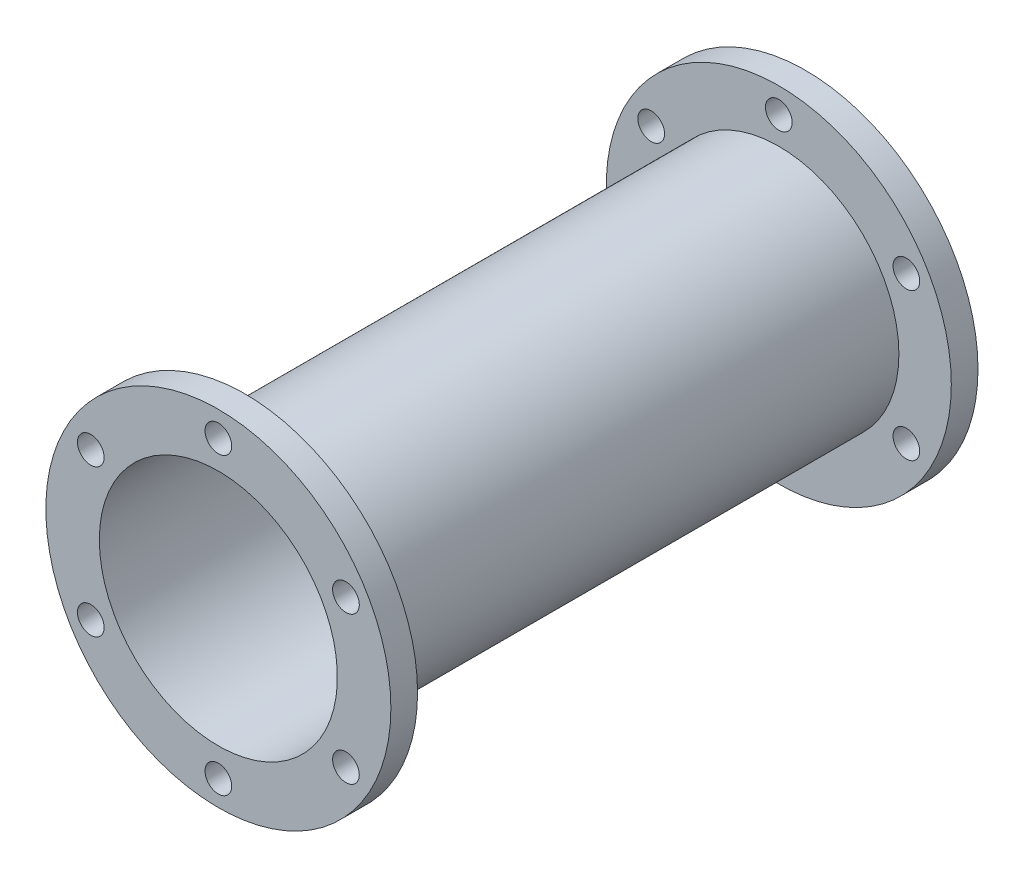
from build123d import *

# Parameters (mm, degrees)
SKETCH1_R           = 41.0464
BOSS_EXTRUDE1_DEPTH = 6.35
SKETCH2_R           = 3.175
CUT_EXTRUDE1_DEPTH  = 59.394660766
CIRPATTERN1_COUNT   = 6
SKETCH3_R           = 28.575
BOSS_EXTRUDE2_DEPTH = 127
SKETCH4_R           = 41.0464
BOSS_EXTRUDE3_DEPTH = 6.35
SKETCH6_R           = 28.321
CUT_EXTRUDE5_DEPTH  = 152.280216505
SKETCH8_R           = 3.175
CUT_EXTRUDE6_DEPTH  = 6.35
CIRPATTERN2_COUNT   = 6


with BuildPart() as part:
    # Sketch1 → Boss-Extrude1 (new body)
    with BuildSketch(Plane.XY):
        Circle(SKETCH1_R)
    extrude(amount=BOSS_EXTRUDE1_DEPTH)

    # Sketch2 → Cut-Extrude1 (cut, through all)
    with BuildSketch(Plane.XY.offset(6.35)):
        with Locations((0, 35.052)):
            Circle(SKETCH2_R)
    cut_extrude1 = extrude(amount=-CUT_EXTRUDE1_DEPTH, mode=Mode.SUBTRACT)

    # CirPattern1: Cut-Extrude1 ×6 about axis
    cirpattern1_axis = Axis((0, 0, 0), (0, 0, 1))
    for i in range(1, CIRPATTERN1_COUNT):
        add(cut_extrude1.rotate(cirpattern1_axis, i * 360 / CIRPATTERN1_COUNT), mode=Mode.SUBTRACT)

    # Sketch3 → Boss-Extrude2 (add)
    with BuildSketch(Plane.XY.offset(6.35)):
        Circle(SKETCH3_R)
    extrude(amount=BOSS_EXTRUDE2_DEPTH)

    # Sketch4 → Boss-Extrude3 (add)
    with BuildSketch(Plane.XY.offset(133.35)):
        Circle(SKETCH4_R)
    extrude(amount=BOSS_EXTRUDE3_DEPTH)

    # Sketch6 → Cut-Extrude5 (cut, through all)
    with BuildSketch(Plane(origin=(0, 0, 0), x_dir=(-1, 0, 0), z_dir=(0, 0, -1))):
        Circle(SKETCH6_R)
    extrude(amount=-CUT_EXTRUDE5_DEPTH, mode=Mode.SUBTRACT)

    # Sketch8 → Cut-Extrude6 (cut)
    with BuildSketch(Plane.XY.offset(139.7)):
        with Locations((0, 35.052)):
            Circle(SKETCH8_R)
    cut_extrude6 = extrude(amount=-CUT_EXTRUDE6_DEPTH, mode=Mode.SUBTRACT)

    # CirPattern2: Cut-Extrude6 ×6 about axis
    cirpattern2_axis = Axis((0, 0, 0), (0, 0, 1))
    for i in range(1, CIRPATTERN2_COUNT):
        add(cut_extrude6.rotate(cirpattern2_axis, i * 360 / CIRPATTERN2_COUNT), mode=Mode.SUBTRACT)


solid = part.part
